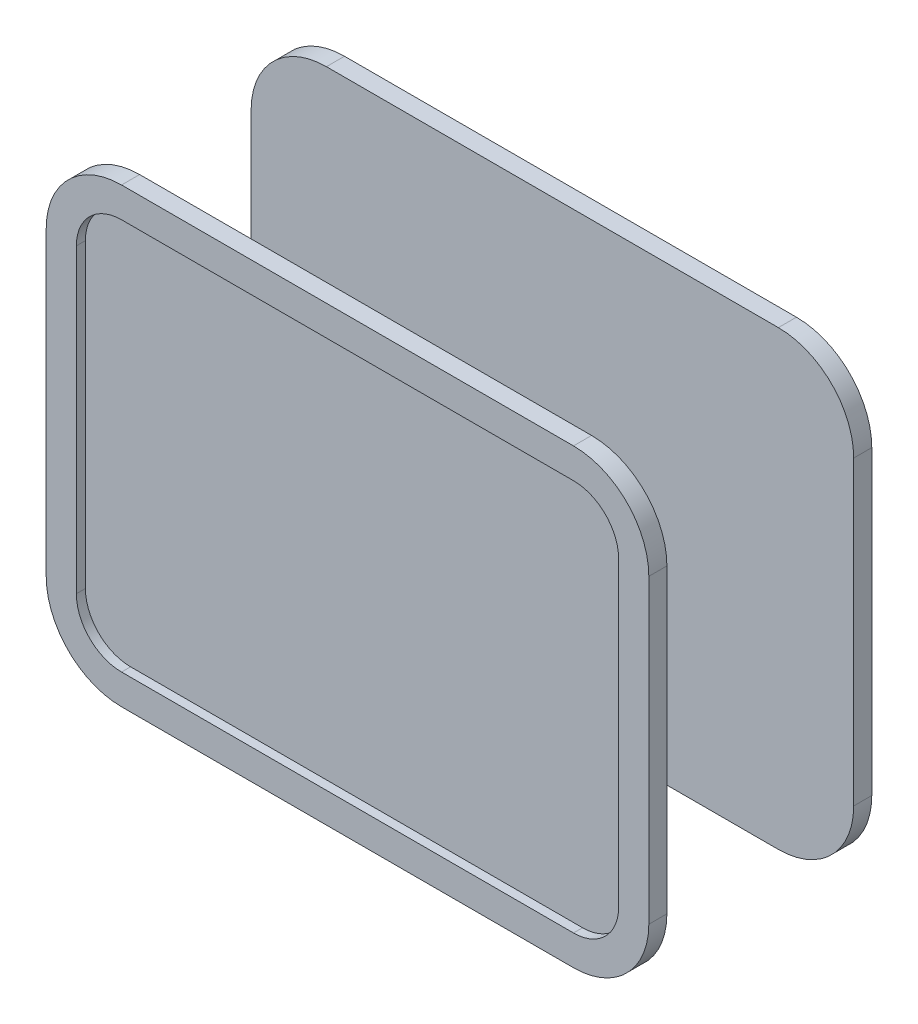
from build123d import *

# Parameters (mm, degrees)
BOSS_EXTRU_1_START      = 31
BOSS_EXTRU_1_DEPTH      = 6
ENL_V_MAT_EXTRU_1_DEPTH = 3
ESQUISSE4_R             = 7
ESQUISSE4_R_2           = 4
BOSS_EXTRU_3_DEPTH      = 31
BOSS_EXTRU_4_DEPTH      = 12
BOSS_EXTRU_4_DEPTH_BACK = 90
ESQUISSE5_R             = 7
ESQUISSE5_R_2           = 4
ESQUISSE6_W             = 22
ESQUISSE6_H             = 22
BOSS_EXTRU_5_DEPTH      = 11


with BuildPart() as part:
    # Esquisse1 → Boss.-Extru.1 (new body)
    with BuildSketch(Plane.XY.offset(BOSS_EXTRU_1_START)):
        with BuildLine():
            Line((-35, 75), (115, 75))
            ThreePointArc((115, 75), (132.67766953, 67.67766953), (140, 50))
            Line((140, 50), (140, -50))
            ThreePointArc((140, -50), (132.67766953, -67.67766953), (115, -75))
            Line((115, -75), (-35, -75))
            ThreePointArc((-35, -75), (-52.67766953, -67.67766953), (-60, -50))
            Line((-60, -50), (-60, 50))
            ThreePointArc((-60, 50), (-52.67766953, 67.67766953), (-35, 75))
        make_face()
    boss_extru_1 = extrude(amount=BOSS_EXTRU_1_DEPTH)

    # Esquisse2 → Enl_v. mat.-Extru.1 (cut)
    with BuildSketch(Plane.XY.offset(37)):
        with BuildLine():
            Line((130, -50), (130, 50))
            ThreePointArc((130, 50), (125.606601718, 60.606601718), (115, 65))
            Line((115, 65), (-35, 65))
            ThreePointArc((-35, 65), (-45.606601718, 60.606601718), (-50, 50))
            Line((-50, 50), (-50, -50))
            ThreePointArc((-50, -50), (-45.606601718, -60.606601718), (-35, -65))
            Line((-35, -65), (115, -65))
            ThreePointArc((115, -65), (125.606601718, -60.606601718), (130, -50))
        make_face()
    enl_v_mat_extru_1 = extrude(amount=-ENL_V_MAT_EXTRU_1_DEPTH, mode=Mode.SUBTRACT)

    # Esquisse4 → Boss.-Extru.3 (add, symmetric)
    with BuildSketch(Plane.XY):
        Circle(ESQUISSE4_R)
        Circle(ESQUISSE4_R_2, mode=Mode.SUBTRACT)
    extrude(amount=BOSS_EXTRU_3_DEPTH, both=True)

    # Esquisse5 → Boss.-Extru.4 (add, two sides: drawn at the far end of the back side and taken through both)
    with BuildSketch(Plane(origin=(0, 0, 0), x_dir=(0, 0, -1), z_dir=(1, 0, 0)).offset(-BOSS_EXTRU_4_DEPTH_BACK)):
        with Locations(Location((0, 0, 0), (0, 0, 270))):
            Circle(ESQUISSE5_R)
        with Locations(Location((0, 0, 0), (0, 0, 180))):
            Circle(ESQUISSE5_R_2, mode=Mode.SUBTRACT)
    extrude(amount=BOSS_EXTRU_4_DEPTH + BOSS_EXTRU_4_DEPTH_BACK)

    # Esquisse6 → Boss.-Extru.5 (add, symmetric)
    with BuildSketch(Plane(origin=(0, 0, 0), x_dir=(1, 0, 0), z_dir=(0, 1, 0))):
        Rectangle(ESQUISSE6_W, ESQUISSE6_H)
    extrude(amount=BOSS_EXTRU_5_DEPTH, both=True)

    # Sym_trie1: Boss.-Extru.1, Enl_v. mat.-Extru.1 across plane
    add(boss_extru_1.mirror(Plane.XY))
    add(enl_v_mat_extru_1.mirror(Plane.XY), mode=Mode.SUBTRACT)


solid = part.part
